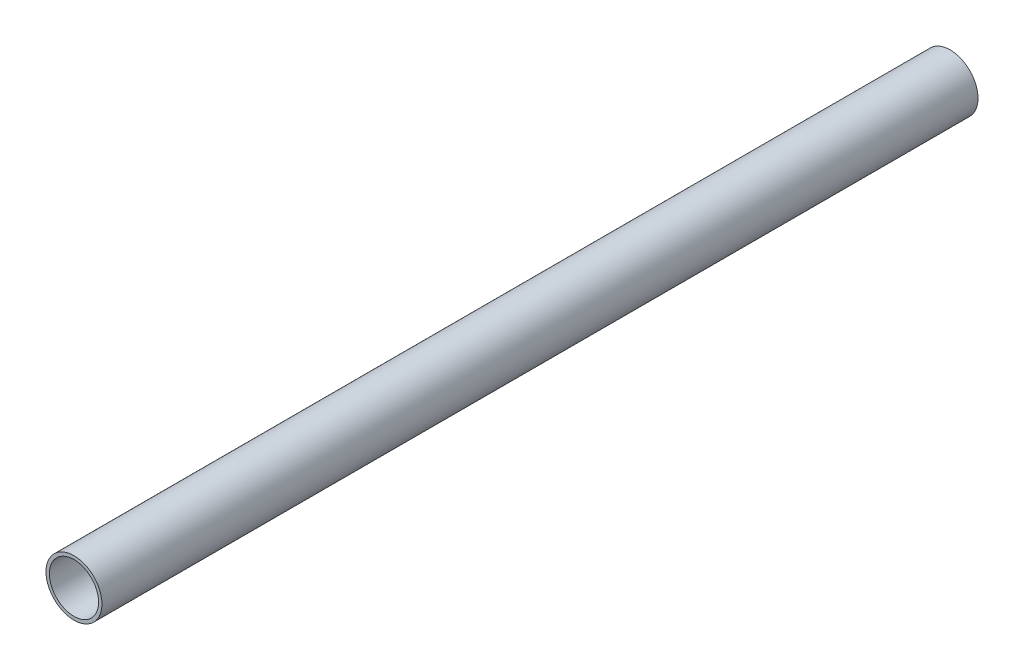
ISO-10303-21;
HEADER;
FILE_DESCRIPTION(('STEP AP214'),'2;1');
FILE_NAME('part.step','',(''),(''),'','','');
FILE_SCHEMA(('AUTOMOTIVE_DESIGN { 1 0 10303 214 1 1 1 1 }'));
ENDSEC;
DATA;
#1=APPLICATION_CONTEXT('core data for automotive mechanical design processes');
#2=APPLICATION_PROTOCOL_DEFINITION('international standard','automotive_design',2000,#1);
#3=PRODUCT_CONTEXT('',#1,'mechanical');
#4=PRODUCT('Part','Part','',(#3));
#5=PRODUCT_RELATED_PRODUCT_CATEGORY('part','',(#4));
#6=PRODUCT_DEFINITION_FORMATION('','',#4);
#7=PRODUCT_DEFINITION_CONTEXT('part definition',#1,'design');
#8=PRODUCT_DEFINITION('design','',#6,#7);
#9=PRODUCT_DEFINITION_SHAPE('','',#8);
#10=(LENGTH_UNIT() NAMED_UNIT(*) SI_UNIT(.MILLI.,.METRE.));
#11=(NAMED_UNIT(*) PLANE_ANGLE_UNIT() SI_UNIT($,.RADIAN.));
#12=(NAMED_UNIT(*) SI_UNIT($,.STERADIAN.) SOLID_ANGLE_UNIT());
#13=UNCERTAINTY_MEASURE_WITH_UNIT(LENGTH_MEASURE(1.E-05),#10,'distance_accuracy_value','');
#14=(GEOMETRIC_REPRESENTATION_CONTEXT(3) GLOBAL_UNCERTAINTY_ASSIGNED_CONTEXT((#13)) GLOBAL_UNIT_ASSIGNED_CONTEXT((#10,
#11,#12)) REPRESENTATION_CONTEXT('',''));
#15=CARTESIAN_POINT('',(0.,0.,0.));
#16=DIRECTION('',(0.,0.,1.));
#17=DIRECTION('',(1.,0.,0.));
#18=AXIS2_PLACEMENT_3D('',#15,#16,#17);
#19=CARTESIAN_POINT('',(0.,0.,197.4));
#20=DIRECTION('',(0.,0.,-1.));
#21=DIRECTION('',(-1.,0.,0.));
#22=AXIS2_PLACEMENT_3D('',#19,#20,#21);
#23=CYLINDRICAL_SURFACE('',#22,22.);
#24=CARTESIAN_POINT('',(0.,0.,333.3438220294));
#25=DIRECTION('',(0.,0.,-1.));
#26=DIRECTION('',(-1.,0.,0.));
#27=AXIS2_PLACEMENT_3D('',#24,#25,#26);
#28=CIRCLE('',#27,22.);
#29=CARTESIAN_POINT('',(-22.,0.,333.3438220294));
#30=VERTEX_POINT('',#29);
#31=EDGE_CURVE('E35',#30,#30,#28,.F.);
#32=ORIENTED_EDGE('',*,*,#31,.T.);
#33=EDGE_LOOP('',(#32));
#34=FACE_BOUND('',#33,.T.);
#35=CARTESIAN_POINT('',(0.,0.,-449.7655779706));
#36=DIRECTION('',(0.,0.,-1.));
#37=DIRECTION('',(-1.,0.,0.));
#38=AXIS2_PLACEMENT_3D('',#35,#36,#37);
#39=CIRCLE('',#38,22.);
#40=CARTESIAN_POINT('',(-22.,0.,-449.7655779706));
#41=VERTEX_POINT('',#40);
#42=EDGE_CURVE('E42',#41,#41,#39,.F.);
#43=ORIENTED_EDGE('',*,*,#42,.F.);
#44=EDGE_LOOP('',(#43));
#45=FACE_BOUND('',#44,.T.);
#46=ADVANCED_FACE('F32',(#34,#45),#23,.F.);
#47=CARTESIAN_POINT('',(0.,0.,197.4));
#48=DIRECTION('',(0.,0.,-1.));
#49=DIRECTION('',(-1.,0.,0.));
#50=AXIS2_PLACEMENT_3D('',#47,#48,#49);
#51=CYLINDRICAL_SURFACE('',#50,25.);
#52=CARTESIAN_POINT('',(0.,0.,333.3438220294));
#53=DIRECTION('',(0.,0.,-1.));
#54=DIRECTION('',(-1.,0.,0.));
#55=AXIS2_PLACEMENT_3D('',#52,#53,#54);
#56=CIRCLE('',#55,25.);
#57=CARTESIAN_POINT('',(-25.,0.,333.3438220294));
#58=VERTEX_POINT('',#57);
#59=EDGE_CURVE('E10',#58,#58,#56,.T.);
#60=ORIENTED_EDGE('',*,*,#59,.T.);
#61=EDGE_LOOP('',(#60));
#62=FACE_BOUND('',#61,.T.);
#63=CARTESIAN_POINT('',(0.,0.,-449.7655779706));
#64=DIRECTION('',(0.,0.,-1.));
#65=DIRECTION('',(-1.,0.,0.));
#66=AXIS2_PLACEMENT_3D('',#63,#64,#65);
#67=CIRCLE('',#66,25.);
#68=CARTESIAN_POINT('',(-25.,0.,-449.7655779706));
#69=VERTEX_POINT('',#68);
#70=EDGE_CURVE('E46',#69,#69,#67,.T.);
#71=ORIENTED_EDGE('',*,*,#70,.F.);
#72=EDGE_LOOP('',(#71));
#73=FACE_BOUND('',#72,.T.);
#74=ADVANCED_FACE('F53',(#62,#73),#51,.T.);
#75=CARTESIAN_POINT('',(0.,0.,333.3438220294));
#76=DIRECTION('',(0.,0.,-1.));
#77=DIRECTION('',(-1.,0.,0.));
#78=AXIS2_PLACEMENT_3D('',#75,#76,#77);
#79=PLANE('',#78);
#80=ORIENTED_EDGE('',*,*,#31,.F.);
#81=EDGE_LOOP('',(#80));
#82=FACE_BOUND('',#81,.T.);
#83=ORIENTED_EDGE('',*,*,#59,.F.);
#84=EDGE_LOOP('',(#83));
#85=FACE_BOUND('',#84,.T.);
#86=ADVANCED_FACE('F55',(#82,#85),#79,.F.);
#87=CARTESIAN_POINT('',(0.,0.,-449.7655779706));
#88=DIRECTION('',(0.,0.,-1.));
#89=DIRECTION('',(-1.,0.,0.));
#90=AXIS2_PLACEMENT_3D('',#87,#88,#89);
#91=PLANE('',#90);
#92=ORIENTED_EDGE('',*,*,#70,.T.);
#93=EDGE_LOOP('',(#92));
#94=FACE_BOUND('',#93,.T.);
#95=ORIENTED_EDGE('',*,*,#42,.T.);
#96=EDGE_LOOP('',(#95));
#97=FACE_BOUND('',#96,.T.);
#98=ADVANCED_FACE('F50',(#94,#97),#91,.T.);
#99=CLOSED_SHELL('',(#46,#74,#86,#98));
#100=MANIFOLD_SOLID_BREP('B2',#99);
#101=ADVANCED_BREP_SHAPE_REPRESENTATION('',(#18,#100),#14);
#102=SHAPE_DEFINITION_REPRESENTATION(#9,#101);
ENDSEC;
END-ISO-10303-21;
